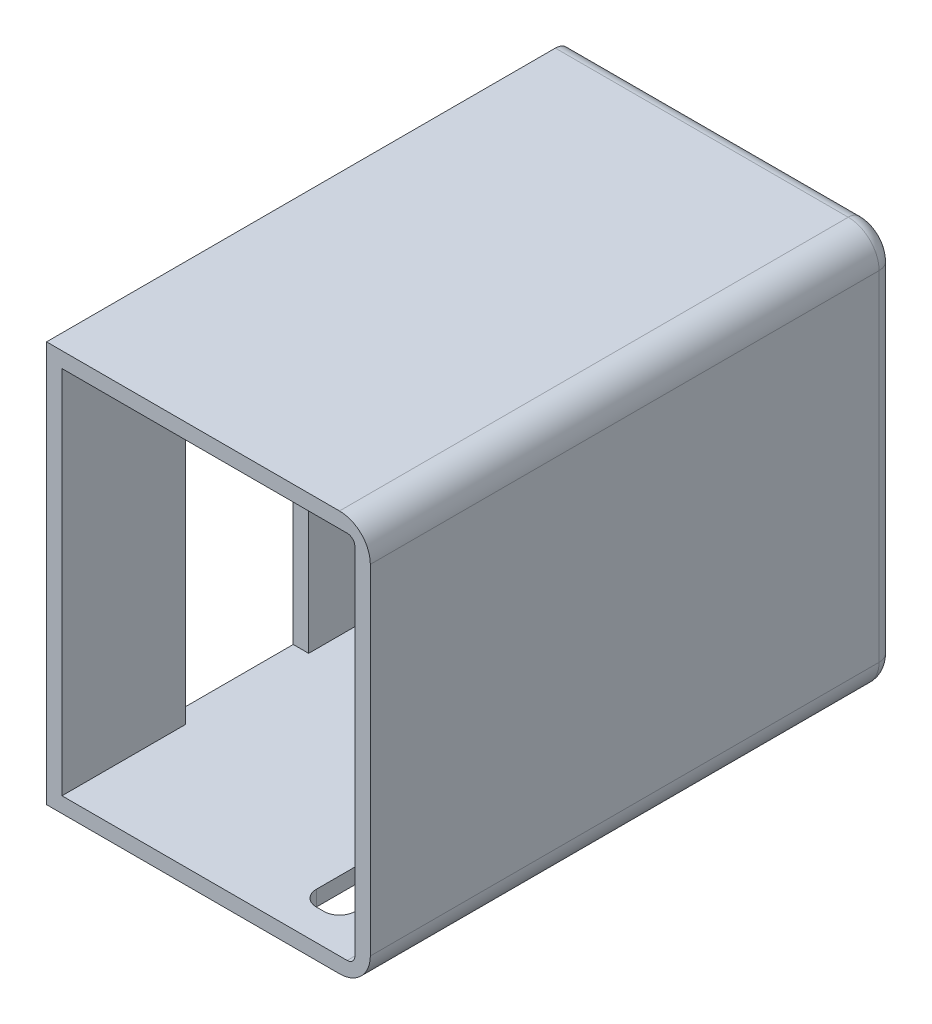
ISO-10303-21;
HEADER;
FILE_DESCRIPTION(('STEP AP214'),'2;1');
FILE_NAME('part.step','',(''),(''),'','','');
FILE_SCHEMA(('AUTOMOTIVE_DESIGN { 1 0 10303 214 1 1 1 1 }'));
ENDSEC;
DATA;
#1=APPLICATION_CONTEXT('core data for automotive mechanical design processes');
#2=APPLICATION_PROTOCOL_DEFINITION('international standard','automotive_design',2000,#1);
#3=PRODUCT_CONTEXT('',#1,'mechanical');
#4=PRODUCT('Part','Part','',(#3));
#5=PRODUCT_RELATED_PRODUCT_CATEGORY('part','',(#4));
#6=PRODUCT_DEFINITION_FORMATION('','',#4);
#7=PRODUCT_DEFINITION_CONTEXT('part definition',#1,'design');
#8=PRODUCT_DEFINITION('design','',#6,#7);
#9=PRODUCT_DEFINITION_SHAPE('','',#8);
#10=(LENGTH_UNIT() NAMED_UNIT(*) SI_UNIT(.MILLI.,.METRE.));
#11=(NAMED_UNIT(*) PLANE_ANGLE_UNIT() SI_UNIT($,.RADIAN.));
#12=(NAMED_UNIT(*) SI_UNIT($,.STERADIAN.) SOLID_ANGLE_UNIT());
#13=UNCERTAINTY_MEASURE_WITH_UNIT(LENGTH_MEASURE(1.E-05),#10,'distance_accuracy_value','');
#14=(GEOMETRIC_REPRESENTATION_CONTEXT(3) GLOBAL_UNCERTAINTY_ASSIGNED_CONTEXT((#13)) GLOBAL_UNIT_ASSIGNED_CONTEXT((#10,
#11,#12)) REPRESENTATION_CONTEXT('',''));
#15=CARTESIAN_POINT('',(0.,0.,0.));
#16=DIRECTION('',(0.,0.,1.));
#17=DIRECTION('',(1.,0.,0.));
#18=AXIS2_PLACEMENT_3D('',#15,#16,#17);
#19=CARTESIAN_POINT('',(-95.,120.,330.));
#20=DIRECTION('',(1.,0.,0.));
#21=DIRECTION('',(0.,1.,0.));
#22=AXIS2_PLACEMENT_3D('',#19,#20,#21);
#23=PLANE('',#22);
#24=DIRECTION('',(0.,0.,-1.));
#25=VECTOR('',#24,1.);
#26=CARTESIAN_POINT('',(-95.,-120.,330.));
#27=LINE('',#26,#25);
#28=CARTESIAN_POINT('',(-95.,-120.,330.));
#29=VERTEX_POINT('',#28);
#30=CARTESIAN_POINT('',(-95.,-120.,250.));
#31=VERTEX_POINT('',#30);
#32=EDGE_CURVE('E395',#29,#31,#27,.T.);
#33=ORIENTED_EDGE('',*,*,#32,.T.);
#34=DIRECTION('',(0.,-1.,0.));
#35=VECTOR('',#34,1.);
#36=CARTESIAN_POINT('',(-95.,0.,250.));
#37=LINE('',#36,#35);
#38=CARTESIAN_POINT('',(-95.0000000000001,120.,250.));
#39=VERTEX_POINT('',#38);
#40=EDGE_CURVE('E321',#39,#31,#37,.T.);
#41=ORIENTED_EDGE('',*,*,#40,.F.);
#42=DIRECTION('',(0.,0.,-1.));
#43=VECTOR('',#42,1.);
#44=CARTESIAN_POINT('',(-95.,120.,330.));
#45=LINE('',#44,#43);
#46=CARTESIAN_POINT('',(-95.,120.,330.));
#47=VERTEX_POINT('',#46);
#48=EDGE_CURVE('E400',#47,#39,#45,.T.);
#49=ORIENTED_EDGE('',*,*,#48,.F.);
#50=DIRECTION('',(0.,-1.,0.));
#51=VECTOR('',#50,1.);
#52=CARTESIAN_POINT('',(-95.,120.,330.));
#53=LINE('',#52,#51);
#54=EDGE_CURVE('E379',#47,#29,#53,.T.);
#55=ORIENTED_EDGE('',*,*,#54,.T.);
#56=EDGE_LOOP('',(#33,#41,#49,#55));
#57=FACE_BOUND('',#56,.T.);
#58=ADVANCED_FACE('F38',(#57),#23,.T.);
#59=DIRECTION('',(0.,-1.,0.));
#60=VECTOR('',#59,1.);
#61=CARTESIAN_POINT('',(-95.,0.,170.));
#62=LINE('',#61,#60);
#63=CARTESIAN_POINT('',(-95.0000000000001,120.,170.));
#64=VERTEX_POINT('',#63);
#65=CARTESIAN_POINT('',(-95.,-120.,170.));
#66=VERTEX_POINT('',#65);
#67=EDGE_CURVE('E318',#64,#66,#62,.T.);
#68=ORIENTED_EDGE('',*,*,#67,.T.);
#69=CARTESIAN_POINT('',(-95.,-120.,89.9999999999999));
#70=VERTEX_POINT('',#69);
#71=EDGE_CURVE('E399',#66,#70,#27,.T.);
#72=ORIENTED_EDGE('',*,*,#71,.T.);
#73=DIRECTION('',(0.,-1.,0.));
#74=VECTOR('',#73,1.);
#75=CARTESIAN_POINT('',(-95.,0.,89.9999999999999));
#76=LINE('',#75,#74);
#77=CARTESIAN_POINT('',(-95.0000000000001,120.,89.9999999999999));
#78=VERTEX_POINT('',#77);
#79=EDGE_CURVE('E349',#78,#70,#76,.T.);
#80=ORIENTED_EDGE('',*,*,#79,.F.);
#81=EDGE_CURVE('E404',#64,#78,#45,.T.);
#82=ORIENTED_EDGE('',*,*,#81,.F.);
#83=EDGE_LOOP('',(#68,#72,#80,#82));
#84=FACE_BOUND('',#83,.T.);
#85=ADVANCED_FACE('F543',(#84),#23,.T.);
#86=CARTESIAN_POINT('',(0.,0.,330.));
#87=DIRECTION('',(0.,0.,1.));
#88=DIRECTION('',(1.,0.,0.));
#89=AXIS2_PLACEMENT_3D('',#86,#87,#88);
#90=PLANE('',#89);
#91=DIRECTION('',(0.,1.,0.));
#92=VECTOR('',#91,1.);
#93=CARTESIAN_POINT('',(105.,130.,330.));
#94=LINE('',#93,#92);
#95=CARTESIAN_POINT('',(105.,-110.,330.));
#96=VERTEX_POINT('',#95);
#97=CARTESIAN_POINT('',(105.,110.,330.));
#98=VERTEX_POINT('',#97);
#99=EDGE_CURVE('E403',#96,#98,#94,.T.);
#100=ORIENTED_EDGE('',*,*,#99,.T.);
#101=CARTESIAN_POINT('',(84.9999999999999,110.,330.));
#102=DIRECTION('',(0.,0.,1.));
#103=DIRECTION('',(1.,0.,0.));
#104=AXIS2_PLACEMENT_3D('',#101,#102,#103);
#105=CIRCLE('',#104,20.);
#106=CARTESIAN_POINT('',(84.9999999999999,130.,330.));
#107=VERTEX_POINT('',#106);
#108=EDGE_CURVE('E430',#98,#107,#105,.T.);
#109=ORIENTED_EDGE('',*,*,#108,.T.);
#110=DIRECTION('',(-1.,0.,0.));
#111=VECTOR('',#110,1.);
#112=CARTESIAN_POINT('',(-105.,130.,330.));
#113=LINE('',#112,#111);
#114=CARTESIAN_POINT('',(-105.,130.,330.));
#115=VERTEX_POINT('',#114);
#116=EDGE_CURVE('E407',#107,#115,#113,.T.);
#117=ORIENTED_EDGE('',*,*,#116,.T.);
#118=DIRECTION('',(0.,-1.,0.));
#119=VECTOR('',#118,1.);
#120=CARTESIAN_POINT('',(-105.,130.,330.));
#121=LINE('',#120,#119);
#122=CARTESIAN_POINT('',(-105.,-130.,330.));
#123=VERTEX_POINT('',#122);
#124=EDGE_CURVE('E409',#115,#123,#121,.T.);
#125=ORIENTED_EDGE('',*,*,#124,.T.);
#126=DIRECTION('',(1.,0.,0.));
#127=VECTOR('',#126,1.);
#128=CARTESIAN_POINT('',(-105.,-130.,330.));
#129=LINE('',#128,#127);
#130=CARTESIAN_POINT('',(85.,-130.,330.));
#131=VERTEX_POINT('',#130);
#132=EDGE_CURVE('E411',#123,#131,#129,.T.);
#133=ORIENTED_EDGE('',*,*,#132,.T.);
#134=CARTESIAN_POINT('',(85.,-110.,330.));
#135=DIRECTION('',(0.,0.,1.));
#136=DIRECTION('',(1.,0.,0.));
#137=AXIS2_PLACEMENT_3D('',#134,#135,#136);
#138=CIRCLE('',#137,20.);
#139=EDGE_CURVE('E423',#131,#96,#138,.T.);
#140=ORIENTED_EDGE('',*,*,#139,.T.);
#141=EDGE_LOOP('',(#100,#109,#117,#125,#133,#140));
#142=FACE_BOUND('',#141,.T.);
#143=DIRECTION('',(-1.,0.,0.));
#144=VECTOR('',#143,1.);
#145=CARTESIAN_POINT('',(-95.,120.,330.));
#146=LINE('',#145,#144);
#147=CARTESIAN_POINT('',(90.,120.,330.));
#148=VERTEX_POINT('',#147);
#149=EDGE_CURVE('E376',#148,#47,#146,.T.);
#150=ORIENTED_EDGE('',*,*,#149,.F.);
#151=CARTESIAN_POINT('',(90.,115.,330.));
#152=DIRECTION('',(0.,0.,1.));
#153=DIRECTION('',(1.,0.,0.));
#154=AXIS2_PLACEMENT_3D('',#151,#152,#153);
#155=CIRCLE('',#154,5.);
#156=CARTESIAN_POINT('',(95.,115.,330.));
#157=VERTEX_POINT('',#156);
#158=EDGE_CURVE('E448',#148,#157,#155,.F.);
#159=ORIENTED_EDGE('',*,*,#158,.T.);
#160=DIRECTION('',(0.,1.,0.));
#161=VECTOR('',#160,1.);
#162=CARTESIAN_POINT('',(95.,120.,330.));
#163=LINE('',#162,#161);
#164=CARTESIAN_POINT('',(95.,-115.,330.));
#165=VERTEX_POINT('',#164);
#166=EDGE_CURVE('E373',#165,#157,#163,.T.);
#167=ORIENTED_EDGE('',*,*,#166,.F.);
#168=CARTESIAN_POINT('',(90.,-115.,330.));
#169=DIRECTION('',(0.,0.,1.));
#170=DIRECTION('',(1.,0.,0.));
#171=AXIS2_PLACEMENT_3D('',#168,#169,#170);
#172=CIRCLE('',#171,5.);
#173=CARTESIAN_POINT('',(90.,-120.,330.));
#174=VERTEX_POINT('',#173);
#175=EDGE_CURVE('E439',#165,#174,#172,.F.);
#176=ORIENTED_EDGE('',*,*,#175,.T.);
#177=DIRECTION('',(1.,0.,0.));
#178=VECTOR('',#177,1.);
#179=CARTESIAN_POINT('',(-95.,-120.,330.));
#180=LINE('',#179,#178);
#181=EDGE_CURVE('E382',#29,#174,#180,.T.);
#182=ORIENTED_EDGE('',*,*,#181,.F.);
#183=ORIENTED_EDGE('',*,*,#54,.F.);
#184=EDGE_LOOP('',(#150,#159,#167,#176,#182,#183));
#185=FACE_BOUND('',#184,.T.);
#186=ADVANCED_FACE('F519',(#142,#185),#90,.T.);
#187=CARTESIAN_POINT('',(105.,130.,330.));
#188=DIRECTION('',(-1.,0.,0.));
#189=DIRECTION('',(0.,-1.,0.));
#190=AXIS2_PLACEMENT_3D('',#187,#188,#189);
#191=PLANE('',#190);
#192=DIRECTION('',(0.,0.,-1.));
#193=VECTOR('',#192,1.);
#194=CARTESIAN_POINT('',(105.,-110.,330.));
#195=LINE('',#194,#193);
#196=CARTESIAN_POINT('',(105.,-110.,0.));
#197=VERTEX_POINT('',#196);
#198=EDGE_CURVE('E419',#96,#197,#195,.T.);
#199=ORIENTED_EDGE('',*,*,#198,.T.);
#200=DIRECTION('',(0.,-1.,0.));
#201=VECTOR('',#200,1.);
#202=CARTESIAN_POINT('',(105.,110.,0.));
#203=LINE('',#202,#201);
#204=CARTESIAN_POINT('',(105.,110.,0.));
#205=VERTEX_POINT('',#204);
#206=EDGE_CURVE('E469',#197,#205,#203,.F.);
#207=ORIENTED_EDGE('',*,*,#206,.T.);
#208=DIRECTION('',(0.,0.,-1.));
#209=VECTOR('',#208,1.);
#210=CARTESIAN_POINT('',(105.,110.,330.));
#211=LINE('',#210,#209);
#212=EDGE_CURVE('E428',#205,#98,#211,.F.);
#213=ORIENTED_EDGE('',*,*,#212,.T.);
#214=ORIENTED_EDGE('',*,*,#99,.F.);
#215=EDGE_LOOP('',(#199,#207,#213,#214));
#216=FACE_BOUND('',#215,.T.);
#217=ADVANCED_FACE('F524',(#216),#191,.F.);
#218=CARTESIAN_POINT('',(-105.,130.,330.));
#219=DIRECTION('',(0.,-1.,0.));
#220=DIRECTION('',(0.,0.,-1.));
#221=AXIS2_PLACEMENT_3D('',#218,#219,#220);
#222=PLANE('',#221);
#223=DIRECTION('',(0.,0.,-1.));
#224=VECTOR('',#223,1.);
#225=CARTESIAN_POINT('',(84.9999999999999,130.,330.));
#226=LINE('',#225,#224);
#227=CARTESIAN_POINT('',(84.9999999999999,130.,0.));
#228=VERTEX_POINT('',#227);
#229=EDGE_CURVE('E425',#107,#228,#226,.T.);
#230=ORIENTED_EDGE('',*,*,#229,.T.);
#231=DIRECTION('',(1.,0.,0.));
#232=VECTOR('',#231,1.);
#233=CARTESIAN_POINT('',(-105.,130.,0.));
#234=LINE('',#233,#232);
#235=CARTESIAN_POINT('',(-105.,130.,0.));
#236=VERTEX_POINT('',#235);
#237=EDGE_CURVE('E461',#228,#236,#234,.F.);
#238=ORIENTED_EDGE('',*,*,#237,.T.);
#239=DIRECTION('',(0.,0.,-1.));
#240=VECTOR('',#239,1.);
#241=CARTESIAN_POINT('',(-105.,130.,330.));
#242=LINE('',#241,#240);
#243=EDGE_CURVE('E416',#115,#236,#242,.T.);
#244=ORIENTED_EDGE('',*,*,#243,.F.);
#245=ORIENTED_EDGE('',*,*,#116,.F.);
#246=EDGE_LOOP('',(#230,#238,#244,#245));
#247=FACE_BOUND('',#246,.T.);
#248=ADVANCED_FACE('F517',(#247),#222,.F.);
#249=CARTESIAN_POINT('',(-105.,130.,330.));
#250=DIRECTION('',(1.,0.,0.));
#251=DIRECTION('',(0.,1.,0.));
#252=AXIS2_PLACEMENT_3D('',#249,#250,#251);
#253=PLANE('',#252);
#254=DIRECTION('',(0.,-1.,0.));
#255=VECTOR('',#254,1.);
#256=CARTESIAN_POINT('',(-105.,0.,170.));
#257=LINE('',#256,#255);
#258=CARTESIAN_POINT('',(-105.,120.,170.));
#259=VERTEX_POINT('',#258);
#260=CARTESIAN_POINT('',(-105.,-120.,170.));
#261=VERTEX_POINT('',#260);
#262=EDGE_CURVE('E328',#259,#261,#257,.T.);
#263=ORIENTED_EDGE('',*,*,#262,.F.);
#264=DIRECTION('',(0.,0.,-1.));
#265=VECTOR('',#264,1.);
#266=CARTESIAN_POINT('',(-105.,120.,0.));
#267=LINE('',#266,#265);
#268=CARTESIAN_POINT('',(-105.,120.,250.));
#269=VERTEX_POINT('',#268);
#270=EDGE_CURVE('E326',#269,#259,#267,.T.);
#271=ORIENTED_EDGE('',*,*,#270,.F.);
#272=DIRECTION('',(0.,-1.,0.));
#273=VECTOR('',#272,1.);
#274=CARTESIAN_POINT('',(-105.,0.,250.));
#275=LINE('',#274,#273);
#276=CARTESIAN_POINT('',(-105.,-120.,250.));
#277=VERTEX_POINT('',#276);
#278=EDGE_CURVE('E322',#269,#277,#275,.T.);
#279=ORIENTED_EDGE('',*,*,#278,.T.);
#280=DIRECTION('',(0.,0.,-1.));
#281=VECTOR('',#280,1.);
#282=CARTESIAN_POINT('',(-105.,-120.,0.));
#283=LINE('',#282,#281);
#284=EDGE_CURVE('E332',#277,#261,#283,.T.);
#285=ORIENTED_EDGE('',*,*,#284,.T.);
#286=EDGE_LOOP('',(#263,#271,#279,#285));
#287=FACE_BOUND('',#286,.T.);
#288=DIRECTION('',(0.,-1.,0.));
#289=VECTOR('',#288,1.);
#290=CARTESIAN_POINT('',(-105.,0.,9.99999999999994));
#291=LINE('',#290,#289);
#292=CARTESIAN_POINT('',(-105.,120.,9.99999999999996));
#293=VERTEX_POINT('',#292);
#294=CARTESIAN_POINT('',(-105.,-120.,9.99999999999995));
#295=VERTEX_POINT('',#294);
#296=EDGE_CURVE('E355',#293,#295,#291,.T.);
#297=ORIENTED_EDGE('',*,*,#296,.F.);
#298=DIRECTION('',(0.,0.,-1.));
#299=VECTOR('',#298,1.);
#300=CARTESIAN_POINT('',(-105.,120.,0.));
#301=LINE('',#300,#299);
#302=CARTESIAN_POINT('',(-105.,120.,89.9999999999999));
#303=VERTEX_POINT('',#302);
#304=EDGE_CURVE('E306',#303,#293,#301,.T.);
#305=ORIENTED_EDGE('',*,*,#304,.F.);
#306=DIRECTION('',(0.,-1.,0.));
#307=VECTOR('',#306,1.);
#308=CARTESIAN_POINT('',(-105.,0.,89.9999999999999));
#309=LINE('',#308,#307);
#310=CARTESIAN_POINT('',(-105.,-120.,90.));
#311=VERTEX_POINT('',#310);
#312=EDGE_CURVE('E350',#303,#311,#309,.T.);
#313=ORIENTED_EDGE('',*,*,#312,.T.);
#314=DIRECTION('',(0.,0.,-1.));
#315=VECTOR('',#314,1.);
#316=CARTESIAN_POINT('',(-105.,-120.,0.));
#317=LINE('',#316,#315);
#318=EDGE_CURVE('E358',#311,#295,#317,.T.);
#319=ORIENTED_EDGE('',*,*,#318,.T.);
#320=EDGE_LOOP('',(#297,#305,#313,#319));
#321=FACE_BOUND('',#320,.T.);
#322=ORIENTED_EDGE('',*,*,#243,.T.);
#323=CARTESIAN_POINT('',(-105.,120.,0.));
#324=DIRECTION('',(1.,0.,0.));
#325=DIRECTION('',(0.,1.,0.));
#326=AXIS2_PLACEMENT_3D('',#323,#324,#325);
#327=CIRCLE('',#326,10.);
#328=CARTESIAN_POINT('',(-105.,120.,-10.));
#329=VERTEX_POINT('',#328);
#330=EDGE_CURVE('E465',#236,#329,#327,.F.);
#331=ORIENTED_EDGE('',*,*,#330,.T.);
#332=DIRECTION('',(0.,1.,0.));
#333=VECTOR('',#332,1.);
#334=CARTESIAN_POINT('',(-105.,130.,-10.));
#335=LINE('',#334,#333);
#336=CARTESIAN_POINT('',(-105.,-120.,-10.));
#337=VERTEX_POINT('',#336);
#338=EDGE_CURVE('E339',#337,#329,#335,.T.);
#339=ORIENTED_EDGE('',*,*,#338,.F.);
#340=CARTESIAN_POINT('',(-105.,-120.,0.));
#341=DIRECTION('',(1.,0.,0.));
#342=DIRECTION('',(0.,1.,0.));
#343=AXIS2_PLACEMENT_3D('',#340,#341,#342);
#344=CIRCLE('',#343,10.);
#345=CARTESIAN_POINT('',(-105.,-130.,0.));
#346=VERTEX_POINT('',#345);
#347=EDGE_CURVE('E463',#337,#346,#344,.F.);
#348=ORIENTED_EDGE('',*,*,#347,.T.);
#349=DIRECTION('',(0.,0.,-1.));
#350=VECTOR('',#349,1.);
#351=CARTESIAN_POINT('',(-105.,-130.,330.));
#352=LINE('',#351,#350);
#353=EDGE_CURVE('E414',#123,#346,#352,.T.);
#354=ORIENTED_EDGE('',*,*,#353,.F.);
#355=ORIENTED_EDGE('',*,*,#124,.F.);
#356=EDGE_LOOP('',(#322,#331,#339,#348,#354,#355));
#357=FACE_BOUND('',#356,.T.);
#358=ADVANCED_FACE('F495',(#287,#321,#357),#253,.F.);
#359=CARTESIAN_POINT('',(-105.,-130.,330.));
#360=DIRECTION('',(0.,1.,0.));
#361=DIRECTION('',(0.,0.,1.));
#362=AXIS2_PLACEMENT_3D('',#359,#360,#361);
#363=PLANE('',#362);
#364=DIRECTION('',(0.,0.,1.));
#365=VECTOR('',#364,1.);
#366=CARTESIAN_POINT('',(65.,-130.,300.));
#367=LINE('',#366,#365);
#368=CARTESIAN_POINT('',(65.,-130.,20.));
#369=VERTEX_POINT('',#368);
#370=CARTESIAN_POINT('',(65.,-130.,300.));
#371=VERTEX_POINT('',#370);
#372=EDGE_CURVE('E288',#369,#371,#367,.T.);
#373=ORIENTED_EDGE('',*,*,#372,.F.);
#374=CARTESIAN_POINT('',(55.,-130.,20.));
#375=DIRECTION('',(0.,-1.,0.));
#376=DIRECTION('',(0.,0.,-1.));
#377=AXIS2_PLACEMENT_3D('',#374,#375,#376);
#378=CIRCLE('',#377,10.);
#379=CARTESIAN_POINT('',(54.9999999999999,-130.,10.));
#380=VERTEX_POINT('',#379);
#381=EDGE_CURVE('E249',#380,#369,#378,.T.);
#382=ORIENTED_EDGE('',*,*,#381,.F.);
#383=DIRECTION('',(1.,0.,0.));
#384=VECTOR('',#383,1.);
#385=CARTESIAN_POINT('',(50.0000000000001,-130.,10.));
#386=LINE('',#385,#384);
#387=CARTESIAN_POINT('',(50.0000000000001,-130.,10.));
#388=VERTEX_POINT('',#387);
#389=EDGE_CURVE('E268',#388,#380,#386,.T.);
#390=ORIENTED_EDGE('',*,*,#389,.F.);
#391=CARTESIAN_POINT('',(50.,-130.,20.));
#392=DIRECTION('',(0.,-1.,0.));
#393=DIRECTION('',(0.,0.,-1.));
#394=AXIS2_PLACEMENT_3D('',#391,#392,#393);
#395=CIRCLE('',#394,10.);
#396=CARTESIAN_POINT('',(40.,-130.,20.0000000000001));
#397=VERTEX_POINT('',#396);
#398=EDGE_CURVE('E271',#397,#388,#395,.T.);
#399=ORIENTED_EDGE('',*,*,#398,.F.);
#400=DIRECTION('',(0.,0.,-1.));
#401=VECTOR('',#400,1.);
#402=CARTESIAN_POINT('',(40.,-130.,300.));
#403=LINE('',#402,#401);
#404=CARTESIAN_POINT('',(40.,-130.,300.));
#405=VERTEX_POINT('',#404);
#406=EDGE_CURVE('E299',#405,#397,#403,.T.);
#407=ORIENTED_EDGE('',*,*,#406,.F.);
#408=CARTESIAN_POINT('',(50.,-130.,300.));
#409=DIRECTION('',(0.,-1.,0.));
#410=DIRECTION('',(0.,0.,-1.));
#411=AXIS2_PLACEMENT_3D('',#408,#409,#410);
#412=CIRCLE('',#411,10.);
#413=CARTESIAN_POINT('',(50.,-130.,310.));
#414=VERTEX_POINT('',#413);
#415=EDGE_CURVE('E296',#414,#405,#412,.T.);
#416=ORIENTED_EDGE('',*,*,#415,.F.);
#417=DIRECTION('',(-1.,0.,0.));
#418=VECTOR('',#417,1.);
#419=CARTESIAN_POINT('',(50.,-130.,310.));
#420=LINE('',#419,#418);
#421=CARTESIAN_POINT('',(54.9999999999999,-130.,310.));
#422=VERTEX_POINT('',#421);
#423=EDGE_CURVE('E293',#422,#414,#420,.T.);
#424=ORIENTED_EDGE('',*,*,#423,.F.);
#425=CARTESIAN_POINT('',(55.,-130.,300.));
#426=DIRECTION('',(0.,-1.,0.));
#427=DIRECTION('',(0.,0.,1.));
#428=AXIS2_PLACEMENT_3D('',#425,#426,#427);
#429=CIRCLE('',#428,10.);
#430=EDGE_CURVE('E290',#371,#422,#429,.T.);
#431=ORIENTED_EDGE('',*,*,#430,.F.);
#432=EDGE_LOOP('',(#373,#382,#390,#399,#407,#416,#424,#431));
#433=FACE_BOUND('',#432,.T.);
#434=ORIENTED_EDGE('',*,*,#353,.T.);
#435=DIRECTION('',(-1.,0.,0.));
#436=VECTOR('',#435,1.);
#437=CARTESIAN_POINT('',(85.,-130.,0.));
#438=LINE('',#437,#436);
#439=CARTESIAN_POINT('',(85.,-130.,0.));
#440=VERTEX_POINT('',#439);
#441=EDGE_CURVE('E11',#346,#440,#438,.F.);
#442=ORIENTED_EDGE('',*,*,#441,.T.);
#443=DIRECTION('',(0.,0.,-1.));
#444=VECTOR('',#443,1.);
#445=CARTESIAN_POINT('',(85.,-130.,330.));
#446=LINE('',#445,#444);
#447=EDGE_CURVE('E421',#440,#131,#446,.F.);
#448=ORIENTED_EDGE('',*,*,#447,.T.);
#449=ORIENTED_EDGE('',*,*,#132,.F.);
#450=EDGE_LOOP('',(#434,#442,#448,#449));
#451=FACE_BOUND('',#450,.T.);
#452=ADVANCED_FACE('F527',(#433,#451),#363,.F.);
#453=CARTESIAN_POINT('',(95.,120.,330.));
#454=DIRECTION('',(-1.,0.,0.));
#455=DIRECTION('',(0.,-1.,0.));
#456=AXIS2_PLACEMENT_3D('',#453,#454,#455);
#457=PLANE('',#456);
#458=ORIENTED_EDGE('',*,*,#166,.T.);
#459=DIRECTION('',(0.,0.,-1.));
#460=VECTOR('',#459,1.);
#461=CARTESIAN_POINT('',(95.,115.,0.));
#462=LINE('',#461,#460);
#463=CARTESIAN_POINT('',(95.,115.,0.));
#464=VERTEX_POINT('',#463);
#465=EDGE_CURVE('E441',#157,#464,#462,.T.);
#466=ORIENTED_EDGE('',*,*,#465,.T.);
#467=DIRECTION('',(0.,1.,0.));
#468=VECTOR('',#467,1.);
#469=CARTESIAN_POINT('',(95.,120.,0.));
#470=LINE('',#469,#468);
#471=CARTESIAN_POINT('',(95.,-115.,0.));
#472=VERTEX_POINT('',#471);
#473=EDGE_CURVE('E372',#472,#464,#470,.T.);
#474=ORIENTED_EDGE('',*,*,#473,.F.);
#475=DIRECTION('',(0.,0.,-1.));
#476=VECTOR('',#475,1.);
#477=CARTESIAN_POINT('',(95.,-115.,330.));
#478=LINE('',#477,#476);
#479=EDGE_CURVE('E437',#472,#165,#478,.F.);
#480=ORIENTED_EDGE('',*,*,#479,.T.);
#481=EDGE_LOOP('',(#458,#466,#474,#480));
#482=FACE_BOUND('',#481,.T.);
#483=ADVANCED_FACE('F529',(#482),#457,.T.);
#484=CARTESIAN_POINT('',(-95.,120.,330.));
#485=DIRECTION('',(0.,-1.,0.));
#486=DIRECTION('',(0.,0.,-1.));
#487=AXIS2_PLACEMENT_3D('',#484,#485,#486);
#488=PLANE('',#487);
#489=DIRECTION('',(-1.,0.,0.));
#490=VECTOR('',#489,1.);
#491=CARTESIAN_POINT('',(-95.,120.,0.));
#492=LINE('',#491,#490);
#493=CARTESIAN_POINT('',(90.,120.,0.));
#494=VERTEX_POINT('',#493);
#495=CARTESIAN_POINT('',(-95.,120.,0.));
#496=VERTEX_POINT('',#495);
#497=EDGE_CURVE('E388',#494,#496,#492,.T.);
#498=ORIENTED_EDGE('',*,*,#497,.F.);
#499=DIRECTION('',(0.,0.,-1.));
#500=VECTOR('',#499,1.);
#501=CARTESIAN_POINT('',(90.,120.,330.));
#502=LINE('',#501,#500);
#503=EDGE_CURVE('E446',#494,#148,#502,.F.);
#504=ORIENTED_EDGE('',*,*,#503,.T.);
#505=ORIENTED_EDGE('',*,*,#149,.T.);
#506=ORIENTED_EDGE('',*,*,#48,.T.);
#507=DIRECTION('',(-1.,0.,0.));
#508=VECTOR('',#507,1.);
#509=CARTESIAN_POINT('',(-95.0000000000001,120.,250.));
#510=LINE('',#509,#508);
#511=EDGE_CURVE('E337',#39,#269,#510,.T.);
#512=ORIENTED_EDGE('',*,*,#511,.T.);
#513=ORIENTED_EDGE('',*,*,#270,.T.);
#514=DIRECTION('',(-1.,0.,0.));
#515=VECTOR('',#514,1.);
#516=CARTESIAN_POINT('',(-95.0000000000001,120.,170.));
#517=LINE('',#516,#515);
#518=EDGE_CURVE('E325',#64,#259,#517,.T.);
#519=ORIENTED_EDGE('',*,*,#518,.F.);
#520=ORIENTED_EDGE('',*,*,#81,.T.);
#521=DIRECTION('',(-1.,0.,0.));
#522=VECTOR('',#521,1.);
#523=CARTESIAN_POINT('',(-95.0000000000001,120.,89.9999999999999));
#524=LINE('',#523,#522);
#525=EDGE_CURVE('E329',#78,#303,#524,.T.);
#526=ORIENTED_EDGE('',*,*,#525,.T.);
#527=ORIENTED_EDGE('',*,*,#304,.T.);
#528=DIRECTION('',(-1.,0.,0.));
#529=VECTOR('',#528,1.);
#530=CARTESIAN_POINT('',(-95.0000000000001,120.,9.99999999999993));
#531=LINE('',#530,#529);
#532=CARTESIAN_POINT('',(-95.0000000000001,120.,9.99999999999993));
#533=VERTEX_POINT('',#532);
#534=EDGE_CURVE('E353',#533,#293,#531,.T.);
#535=ORIENTED_EDGE('',*,*,#534,.F.);
#536=EDGE_CURVE('E398',#533,#496,#45,.T.);
#537=ORIENTED_EDGE('',*,*,#536,.T.);
#538=EDGE_LOOP('',(#498,#504,#505,#506,#512,#513,#519,#520,#526,#527,#535,#537));
#539=FACE_BOUND('',#538,.T.);
#540=ADVANCED_FACE('F536',(#539),#488,.T.);
#541=DIRECTION('',(0.,-1.,0.));
#542=VECTOR('',#541,1.);
#543=CARTESIAN_POINT('',(-95.,0.,9.99999999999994));
#544=LINE('',#543,#542);
#545=CARTESIAN_POINT('',(-95.,-120.,9.99999999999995));
#546=VERTEX_POINT('',#545);
#547=EDGE_CURVE('E346',#533,#546,#544,.T.);
#548=ORIENTED_EDGE('',*,*,#547,.T.);
#549=CARTESIAN_POINT('',(-95.,-120.,0.));
#550=VERTEX_POINT('',#549);
#551=EDGE_CURVE('E385',#546,#550,#27,.T.);
#552=ORIENTED_EDGE('',*,*,#551,.T.);
#553=DIRECTION('',(0.,-1.,0.));
#554=VECTOR('',#553,1.);
#555=CARTESIAN_POINT('',(-95.,120.,0.));
#556=LINE('',#555,#554);
#557=EDGE_CURVE('E390',#496,#550,#556,.T.);
#558=ORIENTED_EDGE('',*,*,#557,.F.);
#559=ORIENTED_EDGE('',*,*,#536,.F.);
#560=EDGE_LOOP('',(#548,#552,#558,#559));
#561=FACE_BOUND('',#560,.T.);
#562=ADVANCED_FACE('F546',(#561),#23,.T.);
#563=CARTESIAN_POINT('',(-95.,-120.,330.));
#564=DIRECTION('',(0.,1.,0.));
#565=DIRECTION('',(0.,0.,1.));
#566=AXIS2_PLACEMENT_3D('',#563,#564,#565);
#567=PLANE('',#566);
#568=CARTESIAN_POINT('',(55.,-120.,20.));
#569=DIRECTION('',(0.,-1.,0.));
#570=DIRECTION('',(0.,0.,-1.));
#571=AXIS2_PLACEMENT_3D('',#568,#569,#570);
#572=CIRCLE('',#571,10.);
#573=CARTESIAN_POINT('',(54.9999999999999,-120.,10.));
#574=VERTEX_POINT('',#573);
#575=CARTESIAN_POINT('',(65.,-120.,20.0000000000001));
#576=VERTEX_POINT('',#575);
#577=EDGE_CURVE('E246',#574,#576,#572,.T.);
#578=ORIENTED_EDGE('',*,*,#577,.T.);
#579=DIRECTION('',(0.,0.,1.));
#580=VECTOR('',#579,1.);
#581=CARTESIAN_POINT('',(65.,-120.,300.));
#582=LINE('',#581,#580);
#583=CARTESIAN_POINT('',(65.,-120.,300.));
#584=VERTEX_POINT('',#583);
#585=EDGE_CURVE('E258',#576,#584,#582,.T.);
#586=ORIENTED_EDGE('',*,*,#585,.T.);
#587=CARTESIAN_POINT('',(55.,-120.,300.));
#588=DIRECTION('',(0.,-1.,0.));
#589=DIRECTION('',(0.,0.,1.));
#590=AXIS2_PLACEMENT_3D('',#587,#588,#589);
#591=CIRCLE('',#590,10.);
#592=CARTESIAN_POINT('',(54.9999999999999,-120.,310.));
#593=VERTEX_POINT('',#592);
#594=EDGE_CURVE('E262',#584,#593,#591,.T.);
#595=ORIENTED_EDGE('',*,*,#594,.T.);
#596=DIRECTION('',(-1.,0.,0.));
#597=VECTOR('',#596,1.);
#598=CARTESIAN_POINT('',(50.,-120.,310.));
#599=LINE('',#598,#597);
#600=CARTESIAN_POINT('',(50.,-120.,310.));
#601=VERTEX_POINT('',#600);
#602=EDGE_CURVE('E275',#593,#601,#599,.T.);
#603=ORIENTED_EDGE('',*,*,#602,.T.);
#604=CARTESIAN_POINT('',(50.,-120.,300.));
#605=DIRECTION('',(0.,-1.,0.));
#606=DIRECTION('',(0.,0.,-1.));
#607=AXIS2_PLACEMENT_3D('',#604,#605,#606);
#608=CIRCLE('',#607,10.);
#609=CARTESIAN_POINT('',(40.,-120.,300.));
#610=VERTEX_POINT('',#609);
#611=EDGE_CURVE('E278',#601,#610,#608,.T.);
#612=ORIENTED_EDGE('',*,*,#611,.T.);
#613=DIRECTION('',(0.,0.,-1.));
#614=VECTOR('',#613,1.);
#615=CARTESIAN_POINT('',(40.,-120.,300.));
#616=LINE('',#615,#614);
#617=CARTESIAN_POINT('',(40.,-120.,20.0000000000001));
#618=VERTEX_POINT('',#617);
#619=EDGE_CURVE('E281',#610,#618,#616,.T.);
#620=ORIENTED_EDGE('',*,*,#619,.T.);
#621=CARTESIAN_POINT('',(50.,-120.,20.));
#622=DIRECTION('',(0.,-1.,0.));
#623=DIRECTION('',(0.,0.,-1.));
#624=AXIS2_PLACEMENT_3D('',#621,#622,#623);
#625=CIRCLE('',#624,10.);
#626=CARTESIAN_POINT('',(50.0000000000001,-120.,10.));
#627=VERTEX_POINT('',#626);
#628=EDGE_CURVE('E284',#618,#627,#625,.T.);
#629=ORIENTED_EDGE('',*,*,#628,.T.);
#630=DIRECTION('',(1.,0.,0.));
#631=VECTOR('',#630,1.);
#632=CARTESIAN_POINT('',(50.0000000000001,-120.,10.));
#633=LINE('',#632,#631);
#634=EDGE_CURVE('E254',#627,#574,#633,.T.);
#635=ORIENTED_EDGE('',*,*,#634,.T.);
#636=EDGE_LOOP('',(#578,#586,#595,#603,#612,#620,#629,#635));
#637=FACE_BOUND('',#636,.T.);
#638=ORIENTED_EDGE('',*,*,#181,.T.);
#639=DIRECTION('',(0.,0.,-1.));
#640=VECTOR('',#639,1.);
#641=CARTESIAN_POINT('',(90.,-120.,0.));
#642=LINE('',#641,#640);
#643=CARTESIAN_POINT('',(90.,-120.,0.));
#644=VERTEX_POINT('',#643);
#645=EDGE_CURVE('E432',#174,#644,#642,.T.);
#646=ORIENTED_EDGE('',*,*,#645,.T.);
#647=DIRECTION('',(1.,0.,0.));
#648=VECTOR('',#647,1.);
#649=CARTESIAN_POINT('',(-95.,-120.,0.));
#650=LINE('',#649,#648);
#651=EDGE_CURVE('E377',#550,#644,#650,.T.);
#652=ORIENTED_EDGE('',*,*,#651,.F.);
#653=ORIENTED_EDGE('',*,*,#551,.F.);
#654=DIRECTION('',(-1.,0.,0.));
#655=VECTOR('',#654,1.);
#656=CARTESIAN_POINT('',(-95.,-120.,9.99999999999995));
#657=LINE('',#656,#655);
#658=EDGE_CURVE('E366',#546,#295,#657,.T.);
#659=ORIENTED_EDGE('',*,*,#658,.T.);
#660=ORIENTED_EDGE('',*,*,#318,.F.);
#661=DIRECTION('',(-1.,0.,0.));
#662=VECTOR('',#661,1.);
#663=CARTESIAN_POINT('',(-95.,-120.,90.));
#664=LINE('',#663,#662);
#665=EDGE_CURVE('E364',#70,#311,#664,.T.);
#666=ORIENTED_EDGE('',*,*,#665,.F.);
#667=ORIENTED_EDGE('',*,*,#71,.F.);
#668=DIRECTION('',(-1.,0.,0.));
#669=VECTOR('',#668,1.);
#670=CARTESIAN_POINT('',(-95.,-120.,170.));
#671=LINE('',#670,#669);
#672=EDGE_CURVE('E342',#66,#261,#671,.T.);
#673=ORIENTED_EDGE('',*,*,#672,.T.);
#674=ORIENTED_EDGE('',*,*,#284,.F.);
#675=DIRECTION('',(-1.,0.,0.));
#676=VECTOR('',#675,1.);
#677=CARTESIAN_POINT('',(-95.,-120.,250.));
#678=LINE('',#677,#676);
#679=EDGE_CURVE('E340',#31,#277,#678,.T.);
#680=ORIENTED_EDGE('',*,*,#679,.F.);
#681=ORIENTED_EDGE('',*,*,#32,.F.);
#682=EDGE_LOOP('',(#638,#646,#652,#653,#659,#660,#666,#667,#673,#674,#680,#681));
#683=FACE_BOUND('',#682,.T.);
#684=ADVANCED_FACE('F264',(#637,#683),#567,.T.);
#685=CARTESIAN_POINT('',(0.,0.,0.));
#686=DIRECTION('',(0.,0.,-1.));
#687=DIRECTION('',(-1.,0.,0.));
#688=AXIS2_PLACEMENT_3D('',#685,#686,#687);
#689=PLANE('',#688);
#690=ORIENTED_EDGE('',*,*,#473,.T.);
#691=CARTESIAN_POINT('',(90.,115.,0.));
#692=DIRECTION('',(0.,0.,-1.));
#693=DIRECTION('',(-1.,0.,0.));
#694=AXIS2_PLACEMENT_3D('',#691,#692,#693);
#695=CIRCLE('',#694,5.);
#696=EDGE_CURVE('E444',#464,#494,#695,.F.);
#697=ORIENTED_EDGE('',*,*,#696,.T.);
#698=ORIENTED_EDGE('',*,*,#497,.T.);
#699=ORIENTED_EDGE('',*,*,#557,.T.);
#700=ORIENTED_EDGE('',*,*,#651,.T.);
#701=CARTESIAN_POINT('',(90.,-115.,0.));
#702=DIRECTION('',(0.,0.,-1.));
#703=DIRECTION('',(-1.,0.,0.));
#704=AXIS2_PLACEMENT_3D('',#701,#702,#703);
#705=CIRCLE('',#704,5.);
#706=EDGE_CURVE('E435',#644,#472,#705,.F.);
#707=ORIENTED_EDGE('',*,*,#706,.T.);
#708=EDGE_LOOP('',(#690,#697,#698,#699,#700,#707));
#709=FACE_BOUND('',#708,.T.);
#710=ADVANCED_FACE('F559',(#709),#689,.F.);
#711=CARTESIAN_POINT('',(0.,0.,-10.));
#712=DIRECTION('',(0.,0.,-1.));
#713=DIRECTION('',(-1.,0.,0.));
#714=AXIS2_PLACEMENT_3D('',#711,#712,#713);
#715=PLANE('',#714);
#716=ORIENTED_EDGE('',*,*,#338,.T.);
#717=DIRECTION('',(1.,0.,0.));
#718=VECTOR('',#717,1.);
#719=CARTESIAN_POINT('',(84.9999999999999,120.,-10.));
#720=LINE('',#719,#718);
#721=CARTESIAN_POINT('',(84.9999999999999,120.,-10.));
#722=VERTEX_POINT('',#721);
#723=EDGE_CURVE('E458',#329,#722,#720,.T.);
#724=ORIENTED_EDGE('',*,*,#723,.T.);
#725=CARTESIAN_POINT('',(84.9999999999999,110.,-10.));
#726=DIRECTION('',(0.,0.,-1.));
#727=DIRECTION('',(-1.,0.,0.));
#728=AXIS2_PLACEMENT_3D('',#725,#726,#727);
#729=CIRCLE('',#728,10.);
#730=CARTESIAN_POINT('',(94.9999999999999,110.,-10.));
#731=VERTEX_POINT('',#730);
#732=EDGE_CURVE('E456',#722,#731,#729,.T.);
#733=ORIENTED_EDGE('',*,*,#732,.T.);
#734=DIRECTION('',(0.,-1.,0.));
#735=VECTOR('',#734,1.);
#736=CARTESIAN_POINT('',(95.,-110.,-10.));
#737=LINE('',#736,#735);
#738=CARTESIAN_POINT('',(95.,-110.,-10.));
#739=VERTEX_POINT('',#738);
#740=EDGE_CURVE('E454',#731,#739,#737,.T.);
#741=ORIENTED_EDGE('',*,*,#740,.T.);
#742=CARTESIAN_POINT('',(85.,-110.,-10.));
#743=DIRECTION('',(0.,0.,-1.));
#744=DIRECTION('',(-1.,0.,0.));
#745=AXIS2_PLACEMENT_3D('',#742,#743,#744);
#746=CIRCLE('',#745,10.);
#747=CARTESIAN_POINT('',(85.,-120.,-10.));
#748=VERTEX_POINT('',#747);
#749=EDGE_CURVE('E452',#739,#748,#746,.T.);
#750=ORIENTED_EDGE('',*,*,#749,.T.);
#751=DIRECTION('',(-1.,0.,0.));
#752=VECTOR('',#751,1.);
#753=CARTESIAN_POINT('',(-105.,-120.,-10.));
#754=LINE('',#753,#752);
#755=EDGE_CURVE('E450',#748,#337,#754,.T.);
#756=ORIENTED_EDGE('',*,*,#755,.T.);
#757=EDGE_LOOP('',(#716,#724,#733,#741,#750,#756));
#758=FACE_BOUND('',#757,.T.);
#759=ADVANCED_FACE('F492',(#758),#715,.T.);
#760=CARTESIAN_POINT('',(-95.,0.,89.9999999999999));
#761=DIRECTION('',(0.,0.,-1.));
#762=DIRECTION('',(0.,1.,0.));
#763=AXIS2_PLACEMENT_3D('',#760,#761,#762);
#764=PLANE('',#763);
#765=ORIENTED_EDGE('',*,*,#312,.F.);
#766=ORIENTED_EDGE('',*,*,#525,.F.);
#767=ORIENTED_EDGE('',*,*,#79,.T.);
#768=ORIENTED_EDGE('',*,*,#665,.T.);
#769=EDGE_LOOP('',(#765,#766,#767,#768));
#770=FACE_BOUND('',#769,.T.);
#771=ADVANCED_FACE('F578',(#770),#764,.T.);
#772=CARTESIAN_POINT('',(-95.,0.,9.99999999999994));
#773=DIRECTION('',(0.,0.,-1.));
#774=DIRECTION('',(0.,1.,0.));
#775=AXIS2_PLACEMENT_3D('',#772,#773,#774);
#776=PLANE('',#775);
#777=ORIENTED_EDGE('',*,*,#296,.T.);
#778=ORIENTED_EDGE('',*,*,#658,.F.);
#779=ORIENTED_EDGE('',*,*,#547,.F.);
#780=ORIENTED_EDGE('',*,*,#534,.T.);
#781=EDGE_LOOP('',(#777,#778,#779,#780));
#782=FACE_BOUND('',#781,.T.);
#783=ADVANCED_FACE('F615',(#782),#776,.F.);
#784=CARTESIAN_POINT('',(-95.,0.,250.));
#785=DIRECTION('',(0.,0.,-1.));
#786=DIRECTION('',(0.,1.,0.));
#787=AXIS2_PLACEMENT_3D('',#784,#785,#786);
#788=PLANE('',#787);
#789=ORIENTED_EDGE('',*,*,#278,.F.);
#790=ORIENTED_EDGE('',*,*,#511,.F.);
#791=ORIENTED_EDGE('',*,*,#40,.T.);
#792=ORIENTED_EDGE('',*,*,#679,.T.);
#793=EDGE_LOOP('',(#789,#790,#791,#792));
#794=FACE_BOUND('',#793,.T.);
#795=ADVANCED_FACE('F602',(#794),#788,.T.);
#796=CARTESIAN_POINT('',(-95.,0.,170.));
#797=DIRECTION('',(0.,0.,-1.));
#798=DIRECTION('',(0.,1.,0.));
#799=AXIS2_PLACEMENT_3D('',#796,#797,#798);
#800=PLANE('',#799);
#801=ORIENTED_EDGE('',*,*,#262,.T.);
#802=ORIENTED_EDGE('',*,*,#672,.F.);
#803=ORIENTED_EDGE('',*,*,#67,.F.);
#804=ORIENTED_EDGE('',*,*,#518,.T.);
#805=EDGE_LOOP('',(#801,#802,#803,#804));
#806=FACE_BOUND('',#805,.T.);
#807=ADVANCED_FACE('F606',(#806),#800,.F.);
#808=CARTESIAN_POINT('',(55.,-120.,20.));
#809=DIRECTION('',(0.,-1.,0.));
#810=DIRECTION('',(0.,0.,-1.));
#811=AXIS2_PLACEMENT_3D('',#808,#809,#810);
#812=CYLINDRICAL_SURFACE('',#811,10.);
#813=ORIENTED_EDGE('',*,*,#381,.T.);
#814=DIRECTION('',(0.,-1.,0.));
#815=VECTOR('',#814,1.);
#816=CARTESIAN_POINT('',(65.,-120.,20.0000000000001));
#817=LINE('',#816,#815);
#818=EDGE_CURVE('E242',#576,#369,#817,.T.);
#819=ORIENTED_EDGE('',*,*,#818,.F.);
#820=ORIENTED_EDGE('',*,*,#577,.F.);
#821=DIRECTION('',(0.,-1.,0.));
#822=VECTOR('',#821,1.);
#823=CARTESIAN_POINT('',(54.9999999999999,-120.,10.));
#824=LINE('',#823,#822);
#825=EDGE_CURVE('E304',#574,#380,#824,.T.);
#826=ORIENTED_EDGE('',*,*,#825,.T.);
#827=EDGE_LOOP('',(#813,#819,#820,#826));
#828=FACE_BOUND('',#827,.T.);
#829=ADVANCED_FACE('F244',(#828),#812,.F.);
#830=CARTESIAN_POINT('',(50.0000000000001,-120.,10.));
#831=DIRECTION('',(0.,0.,-1.));
#832=DIRECTION('',(-1.,0.,0.));
#833=AXIS2_PLACEMENT_3D('',#830,#831,#832);
#834=PLANE('',#833);
#835=ORIENTED_EDGE('',*,*,#389,.T.);
#836=ORIENTED_EDGE('',*,*,#825,.F.);
#837=ORIENTED_EDGE('',*,*,#634,.F.);
#838=DIRECTION('',(0.,-1.,0.));
#839=VECTOR('',#838,1.);
#840=CARTESIAN_POINT('',(50.0000000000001,-120.,10.));
#841=LINE('',#840,#839);
#842=EDGE_CURVE('E307',#627,#388,#841,.T.);
#843=ORIENTED_EDGE('',*,*,#842,.T.);
#844=EDGE_LOOP('',(#835,#836,#837,#843));
#845=FACE_BOUND('',#844,.T.);
#846=ADVANCED_FACE('F613',(#845),#834,.F.);
#847=CARTESIAN_POINT('',(50.,-120.,20.));
#848=DIRECTION('',(0.,-1.,0.));
#849=DIRECTION('',(0.,0.,-1.));
#850=AXIS2_PLACEMENT_3D('',#847,#848,#849);
#851=CYLINDRICAL_SURFACE('',#850,10.);
#852=ORIENTED_EDGE('',*,*,#398,.T.);
#853=ORIENTED_EDGE('',*,*,#842,.F.);
#854=ORIENTED_EDGE('',*,*,#628,.F.);
#855=DIRECTION('',(0.,-1.,0.));
#856=VECTOR('',#855,1.);
#857=CARTESIAN_POINT('',(40.,-120.,20.0000000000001));
#858=LINE('',#857,#856);
#859=EDGE_CURVE('E309',#618,#397,#858,.T.);
#860=ORIENTED_EDGE('',*,*,#859,.T.);
#861=EDGE_LOOP('',(#852,#853,#854,#860));
#862=FACE_BOUND('',#861,.T.);
#863=ADVANCED_FACE('F669',(#862),#851,.F.);
#864=CARTESIAN_POINT('',(40.,-120.,300.));
#865=DIRECTION('',(-1.,0.,0.));
#866=DIRECTION('',(0.,0.,1.));
#867=AXIS2_PLACEMENT_3D('',#864,#865,#866);
#868=PLANE('',#867);
#869=ORIENTED_EDGE('',*,*,#406,.T.);
#870=ORIENTED_EDGE('',*,*,#859,.F.);
#871=ORIENTED_EDGE('',*,*,#619,.F.);
#872=DIRECTION('',(0.,-1.,0.));
#873=VECTOR('',#872,1.);
#874=CARTESIAN_POINT('',(40.,-120.,300.));
#875=LINE('',#874,#873);
#876=EDGE_CURVE('E311',#610,#405,#875,.T.);
#877=ORIENTED_EDGE('',*,*,#876,.T.);
#878=EDGE_LOOP('',(#869,#870,#871,#877));
#879=FACE_BOUND('',#878,.T.);
#880=ADVANCED_FACE('F679',(#879),#868,.F.);
#881=CARTESIAN_POINT('',(50.,-120.,300.));
#882=DIRECTION('',(0.,-1.,0.));
#883=DIRECTION('',(0.,0.,-1.));
#884=AXIS2_PLACEMENT_3D('',#881,#882,#883);
#885=CYLINDRICAL_SURFACE('',#884,10.);
#886=ORIENTED_EDGE('',*,*,#415,.T.);
#887=ORIENTED_EDGE('',*,*,#876,.F.);
#888=ORIENTED_EDGE('',*,*,#611,.F.);
#889=DIRECTION('',(0.,-1.,0.));
#890=VECTOR('',#889,1.);
#891=CARTESIAN_POINT('',(50.,-120.,310.));
#892=LINE('',#891,#890);
#893=EDGE_CURVE('E313',#601,#414,#892,.T.);
#894=ORIENTED_EDGE('',*,*,#893,.T.);
#895=EDGE_LOOP('',(#886,#887,#888,#894));
#896=FACE_BOUND('',#895,.T.);
#897=ADVANCED_FACE('F689',(#896),#885,.F.);
#898=CARTESIAN_POINT('',(50.,-120.,310.));
#899=DIRECTION('',(0.,0.,1.));
#900=DIRECTION('',(1.,0.,0.));
#901=AXIS2_PLACEMENT_3D('',#898,#899,#900);
#902=PLANE('',#901);
#903=ORIENTED_EDGE('',*,*,#423,.T.);
#904=ORIENTED_EDGE('',*,*,#893,.F.);
#905=ORIENTED_EDGE('',*,*,#602,.F.);
#906=DIRECTION('',(0.,-1.,0.));
#907=VECTOR('',#906,1.);
#908=CARTESIAN_POINT('',(54.9999999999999,-120.,310.));
#909=LINE('',#908,#907);
#910=EDGE_CURVE('E315',#593,#422,#909,.T.);
#911=ORIENTED_EDGE('',*,*,#910,.T.);
#912=EDGE_LOOP('',(#903,#904,#905,#911));
#913=FACE_BOUND('',#912,.T.);
#914=ADVANCED_FACE('F699',(#913),#902,.F.);
#915=CARTESIAN_POINT('',(55.,-120.,300.));
#916=DIRECTION('',(0.,-1.,0.));
#917=DIRECTION('',(0.,0.,-1.));
#918=AXIS2_PLACEMENT_3D('',#915,#916,#917);
#919=CYLINDRICAL_SURFACE('',#918,10.);
#920=ORIENTED_EDGE('',*,*,#430,.T.);
#921=ORIENTED_EDGE('',*,*,#910,.F.);
#922=ORIENTED_EDGE('',*,*,#594,.F.);
#923=DIRECTION('',(0.,-1.,0.));
#924=VECTOR('',#923,1.);
#925=CARTESIAN_POINT('',(65.,-120.,300.));
#926=LINE('',#925,#924);
#927=EDGE_CURVE('E253',#584,#371,#926,.T.);
#928=ORIENTED_EDGE('',*,*,#927,.T.);
#929=EDGE_LOOP('',(#920,#921,#922,#928));
#930=FACE_BOUND('',#929,.T.);
#931=ADVANCED_FACE('F709',(#930),#919,.F.);
#932=CARTESIAN_POINT('',(65.,-120.,300.));
#933=DIRECTION('',(1.,0.,0.));
#934=DIRECTION('',(0.,0.,-1.));
#935=AXIS2_PLACEMENT_3D('',#932,#933,#934);
#936=PLANE('',#935);
#937=ORIENTED_EDGE('',*,*,#372,.T.);
#938=ORIENTED_EDGE('',*,*,#927,.F.);
#939=ORIENTED_EDGE('',*,*,#585,.F.);
#940=ORIENTED_EDGE('',*,*,#818,.T.);
#941=EDGE_LOOP('',(#937,#938,#939,#940));
#942=FACE_BOUND('',#941,.T.);
#943=ADVANCED_FACE('F259',(#942),#936,.F.);
#944=CARTESIAN_POINT('',(85.,-110.,330.));
#945=DIRECTION('',(0.,0.,-1.));
#946=DIRECTION('',(-1.,0.,0.));
#947=AXIS2_PLACEMENT_3D('',#944,#945,#946);
#948=CYLINDRICAL_SURFACE('',#947,20.);
#949=ORIENTED_EDGE('',*,*,#447,.F.);
#950=CARTESIAN_POINT('',(85.,-110.,0.));
#951=DIRECTION('',(0.,0.,-1.));
#952=DIRECTION('',(-1.,0.,0.));
#953=AXIS2_PLACEMENT_3D('',#950,#951,#952);
#954=CIRCLE('',#953,20.);
#955=EDGE_CURVE('E47',#440,#197,#954,.F.);
#956=ORIENTED_EDGE('',*,*,#955,.T.);
#957=ORIENTED_EDGE('',*,*,#198,.F.);
#958=ORIENTED_EDGE('',*,*,#139,.F.);
#959=EDGE_LOOP('',(#949,#956,#957,#958));
#960=FACE_BOUND('',#959,.T.);
#961=ADVANCED_FACE('F525',(#960),#948,.T.);
#962=CARTESIAN_POINT('',(84.9999999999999,110.,330.));
#963=DIRECTION('',(0.,0.,-1.));
#964=DIRECTION('',(-1.,0.,0.));
#965=AXIS2_PLACEMENT_3D('',#962,#963,#964);
#966=CYLINDRICAL_SURFACE('',#965,20.);
#967=ORIENTED_EDGE('',*,*,#212,.F.);
#968=CARTESIAN_POINT('',(84.9999999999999,110.,0.));
#969=DIRECTION('',(0.,0.,-1.));
#970=DIRECTION('',(-1.,0.,0.));
#971=AXIS2_PLACEMENT_3D('',#968,#969,#970);
#972=CIRCLE('',#971,20.);
#973=EDGE_CURVE('E467',#205,#228,#972,.F.);
#974=ORIENTED_EDGE('',*,*,#973,.T.);
#975=ORIENTED_EDGE('',*,*,#229,.F.);
#976=ORIENTED_EDGE('',*,*,#108,.F.);
#977=EDGE_LOOP('',(#967,#974,#975,#976));
#978=FACE_BOUND('',#977,.T.);
#979=ADVANCED_FACE('F513',(#978),#966,.T.);
#980=CARTESIAN_POINT('',(90.,-115.,330.));
#981=DIRECTION('',(0.,0.,1.));
#982=DIRECTION('',(1.,0.,0.));
#983=AXIS2_PLACEMENT_3D('',#980,#981,#982);
#984=CYLINDRICAL_SURFACE('',#983,5.);
#985=ORIENTED_EDGE('',*,*,#175,.F.);
#986=ORIENTED_EDGE('',*,*,#479,.F.);
#987=ORIENTED_EDGE('',*,*,#706,.F.);
#988=ORIENTED_EDGE('',*,*,#645,.F.);
#989=EDGE_LOOP('',(#985,#986,#987,#988));
#990=FACE_BOUND('',#989,.T.);
#991=ADVANCED_FACE('F595',(#990),#984,.F.);
#992=CARTESIAN_POINT('',(90.,115.,330.));
#993=DIRECTION('',(0.,0.,1.));
#994=DIRECTION('',(1.,0.,0.));
#995=AXIS2_PLACEMENT_3D('',#992,#993,#994);
#996=CYLINDRICAL_SURFACE('',#995,5.);
#997=ORIENTED_EDGE('',*,*,#158,.F.);
#998=ORIENTED_EDGE('',*,*,#503,.F.);
#999=ORIENTED_EDGE('',*,*,#696,.F.);
#1000=ORIENTED_EDGE('',*,*,#465,.F.);
#1001=EDGE_LOOP('',(#997,#998,#999,#1000));
#1002=FACE_BOUND('',#1001,.T.);
#1003=ADVANCED_FACE('F587',(#1002),#996,.F.);
#1004=CARTESIAN_POINT('',(0.,-120.,0.));
#1005=DIRECTION('',(1.,0.,0.));
#1006=DIRECTION('',(0.,0.,-1.));
#1007=AXIS2_PLACEMENT_3D('',#1004,#1005,#1006);
#1008=CYLINDRICAL_SURFACE('',#1007,10.);
#1009=ORIENTED_EDGE('',*,*,#347,.F.);
#1010=ORIENTED_EDGE('',*,*,#755,.F.);
#1011=CARTESIAN_POINT('',(85.,-120.,0.));
#1012=DIRECTION('',(1.,0.,0.));
#1013=DIRECTION('',(0.,0.,-1.));
#1014=AXIS2_PLACEMENT_3D('',#1011,#1012,#1013);
#1015=CIRCLE('',#1014,10.);
#1016=EDGE_CURVE('E42',#440,#748,#1015,.T.);
#1017=ORIENTED_EDGE('',*,*,#1016,.F.);
#1018=ORIENTED_EDGE('',*,*,#441,.F.);
#1019=EDGE_LOOP('',(#1009,#1010,#1017,#1018));
#1020=FACE_BOUND('',#1019,.T.);
#1021=ADVANCED_FACE('F40',(#1020),#1008,.T.);
#1022=CARTESIAN_POINT('',(85.,-110.,0.));
#1023=DIRECTION('',(0.,0.,-1.));
#1024=DIRECTION('',(-1.,0.,0.));
#1025=AXIS2_PLACEMENT_3D('',#1022,#1023,#1024);
#1026=DEGENERATE_TOROIDAL_SURFACE('',#1025,10.,10.,.T.);
#1027=ORIENTED_EDGE('',*,*,#1016,.T.);
#1028=ORIENTED_EDGE('',*,*,#749,.F.);
#1029=CARTESIAN_POINT('',(95.,-110.,0.));
#1030=DIRECTION('',(0.,1.,0.));
#1031=DIRECTION('',(0.,0.,1.));
#1032=AXIS2_PLACEMENT_3D('',#1029,#1030,#1031);
#1033=CIRCLE('',#1032,10.);
#1034=EDGE_CURVE('E476',#197,#739,#1033,.T.);
#1035=ORIENTED_EDGE('',*,*,#1034,.F.);
#1036=ORIENTED_EDGE('',*,*,#955,.F.);
#1037=EDGE_LOOP('',(#1027,#1028,#1035,#1036));
#1038=FACE_BOUND('',#1037,.T.);
#1039=ADVANCED_FACE('F486',(#1038),#1026,.T.);
#1040=CARTESIAN_POINT('',(95.,0.,0.));
#1041=DIRECTION('',(0.,1.,0.));
#1042=DIRECTION('',(-1.,0.,0.));
#1043=AXIS2_PLACEMENT_3D('',#1040,#1041,#1042);
#1044=CYLINDRICAL_SURFACE('',#1043,10.);
#1045=ORIENTED_EDGE('',*,*,#1034,.T.);
#1046=ORIENTED_EDGE('',*,*,#740,.F.);
#1047=CARTESIAN_POINT('',(94.9999999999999,110.,0.));
#1048=DIRECTION('',(0.,1.,0.));
#1049=DIRECTION('',(0.,0.,1.));
#1050=AXIS2_PLACEMENT_3D('',#1047,#1048,#1049);
#1051=CIRCLE('',#1050,10.);
#1052=EDGE_CURVE('E474',#205,#731,#1051,.T.);
#1053=ORIENTED_EDGE('',*,*,#1052,.F.);
#1054=ORIENTED_EDGE('',*,*,#206,.F.);
#1055=EDGE_LOOP('',(#1045,#1046,#1053,#1054));
#1056=FACE_BOUND('',#1055,.T.);
#1057=ADVANCED_FACE('F507',(#1056),#1044,.T.);
#1058=CARTESIAN_POINT('',(84.9999999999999,110.,0.));
#1059=DIRECTION('',(0.,0.,-1.));
#1060=DIRECTION('',(-1.,0.,0.));
#1061=AXIS2_PLACEMENT_3D('',#1058,#1059,#1060);
#1062=DEGENERATE_TOROIDAL_SURFACE('',#1061,10.,10.,.T.);
#1063=ORIENTED_EDGE('',*,*,#1052,.T.);
#1064=ORIENTED_EDGE('',*,*,#732,.F.);
#1065=CARTESIAN_POINT('',(84.9999999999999,120.,0.));
#1066=DIRECTION('',(-1.,0.,0.));
#1067=DIRECTION('',(0.,0.,1.));
#1068=AXIS2_PLACEMENT_3D('',#1065,#1066,#1067);
#1069=CIRCLE('',#1068,10.);
#1070=EDGE_CURVE('E472',#228,#722,#1069,.T.);
#1071=ORIENTED_EDGE('',*,*,#1070,.F.);
#1072=ORIENTED_EDGE('',*,*,#973,.F.);
#1073=EDGE_LOOP('',(#1063,#1064,#1071,#1072));
#1074=FACE_BOUND('',#1073,.T.);
#1075=ADVANCED_FACE('F509',(#1074),#1062,.T.);
#1076=CARTESIAN_POINT('',(0.,120.,0.));
#1077=DIRECTION('',(-1.,0.,0.));
#1078=DIRECTION('',(0.,0.,1.));
#1079=AXIS2_PLACEMENT_3D('',#1076,#1077,#1078);
#1080=CYLINDRICAL_SURFACE('',#1079,10.);
#1081=ORIENTED_EDGE('',*,*,#330,.F.);
#1082=ORIENTED_EDGE('',*,*,#237,.F.);
#1083=ORIENTED_EDGE('',*,*,#1070,.T.);
#1084=ORIENTED_EDGE('',*,*,#723,.F.);
#1085=EDGE_LOOP('',(#1081,#1082,#1083,#1084));
#1086=FACE_BOUND('',#1085,.T.);
#1087=ADVANCED_FACE('F502',(#1086),#1080,.T.);
#1088=CLOSED_SHELL('',(#58,#85,#186,#217,#248,#358,#452,#483,#540,#562,#684,#710,#759,#771,#783,
#795,#807,#829,#846,#863,#880,#897,#914,#931,#943,#961,#979,#991,#1003,#1021,#1039,#1057,#1075,#1087));
#1089=MANIFOLD_SOLID_BREP('B2',#1088);
#1090=ADVANCED_BREP_SHAPE_REPRESENTATION('',(#18,#1089),#14);
#1091=SHAPE_DEFINITION_REPRESENTATION(#9,#1090);
ENDSEC;
END-ISO-10303-21;
